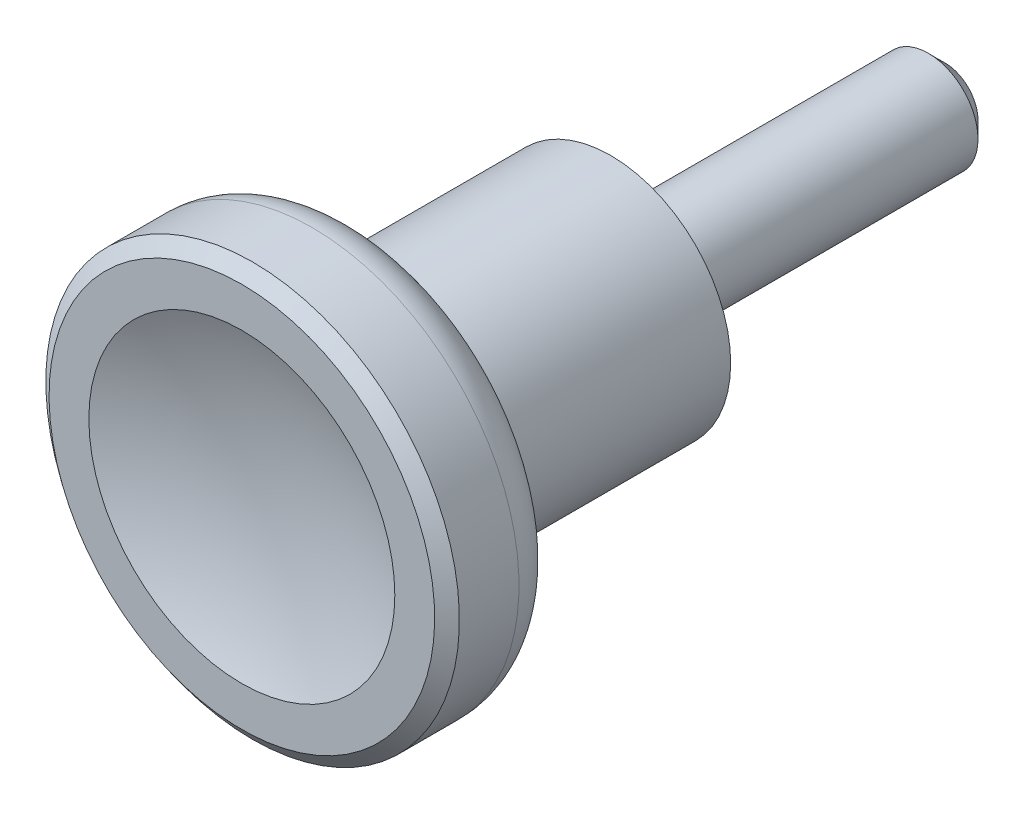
ISO-10303-21;
HEADER;
FILE_DESCRIPTION(('STEP AP214'),'2;1');
FILE_NAME('part.step','',(''),(''),'','','');
FILE_SCHEMA(('AUTOMOTIVE_DESIGN { 1 0 10303 214 1 1 1 1 }'));
ENDSEC;
DATA;
#1=APPLICATION_CONTEXT('core data for automotive mechanical design processes');
#2=APPLICATION_PROTOCOL_DEFINITION('international standard','automotive_design',2000,#1);
#3=PRODUCT_CONTEXT('',#1,'mechanical');
#4=PRODUCT('Part','Part','',(#3));
#5=PRODUCT_RELATED_PRODUCT_CATEGORY('part','',(#4));
#6=PRODUCT_DEFINITION_FORMATION('','',#4);
#7=PRODUCT_DEFINITION_CONTEXT('part definition',#1,'design');
#8=PRODUCT_DEFINITION('design','',#6,#7);
#9=PRODUCT_DEFINITION_SHAPE('','',#8);
#10=(LENGTH_UNIT() NAMED_UNIT(*) SI_UNIT(.MILLI.,.METRE.));
#11=(NAMED_UNIT(*) PLANE_ANGLE_UNIT() SI_UNIT($,.RADIAN.));
#12=(NAMED_UNIT(*) SI_UNIT($,.STERADIAN.) SOLID_ANGLE_UNIT());
#13=UNCERTAINTY_MEASURE_WITH_UNIT(LENGTH_MEASURE(1.E-05),#10,'distance_accuracy_value','');
#14=(GEOMETRIC_REPRESENTATION_CONTEXT(3) GLOBAL_UNCERTAINTY_ASSIGNED_CONTEXT((#13)) GLOBAL_UNIT_ASSIGNED_CONTEXT((#10,
#11,#12)) REPRESENTATION_CONTEXT('',''));
#15=CARTESIAN_POINT('',(0.,0.,0.));
#16=DIRECTION('',(0.,0.,1.));
#17=DIRECTION('',(1.,0.,0.));
#18=AXIS2_PLACEMENT_3D('',#15,#16,#17);
#19=CARTESIAN_POINT('',(0.,0.,43.6847281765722));
#20=DIRECTION('',(0.,-1.,0.));
#21=DIRECTION('',(1.,0.,0.));
#22=AXIS2_PLACEMENT_3D('',#19,#20,#21);
#23=SPHERICAL_SURFACE('',#22,23.1163945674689);
#24=CARTESIAN_POINT('',(0.,0.,43.6847281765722));
#25=DIRECTION('',(0.,0.,-1.));
#26=DIRECTION('',(0.,1.,0.));
#27=AXIS2_PLACEMENT_3D('',#24,#25,#26);
#28=SPHERICAL_SURFACE('',#27,23.1163945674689);
#29=CARTESIAN_POINT('',(0.,0.,22.4988392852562));
#30=DIRECTION('',(0.,0.,-1.));
#31=DIRECTION('',(0.,1.,0.));
#32=AXIS2_PLACEMENT_3D('',#29,#30,#31);
#33=CIRCLE('',#32,9.24801652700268);
#34=CARTESIAN_POINT('',(0.,9.24801652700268,22.4988392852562));
#35=VERTEX_POINT('',#34);
#36=EDGE_CURVE('E56',#35,#35,#33,.T.);
#37=ORIENTED_EDGE('',*,*,#36,.F.);
#38=EDGE_LOOP('',(#37));
#39=FACE_BOUND('',#38,.T.);
#40=ADVANCED_FACE('F12',(#39),#28,.F.);
#41=CARTESIAN_POINT('',(3.,0.,-20.));
#42=DIRECTION('',(0.,0.,1.));
#43=DIRECTION('',(0.,-1.,0.));
#44=AXIS2_PLACEMENT_3D('',#41,#42,#43);
#45=PLANE('',#44);
#46=CARTESIAN_POINT('',(0.,0.,-20.));
#47=DIRECTION('',(0.,0.,1.));
#48=DIRECTION('',(1.,0.,0.));
#49=AXIS2_PLACEMENT_3D('',#46,#47,#48);
#50=CIRCLE('',#49,2.);
#51=CARTESIAN_POINT('',(2.,0.,-20.));
#52=VERTEX_POINT('',#51);
#53=EDGE_CURVE('E19',#52,#52,#50,.F.);
#54=ORIENTED_EDGE('',*,*,#53,.T.);
#55=EDGE_LOOP('',(#54));
#56=FACE_BOUND('',#55,.T.);
#57=ADVANCED_FACE('F63',(#56),#45,.F.);
#58=CARTESIAN_POINT('',(0.,0.,-2.38339822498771));
#59=DIRECTION('',(0.,0.,-1.));
#60=DIRECTION('',(0.,1.,0.));
#61=AXIS2_PLACEMENT_3D('',#58,#59,#60);
#62=CYLINDRICAL_SURFACE('',#61,3.);
#63=CARTESIAN_POINT('',(0.,0.,-19.));
#64=DIRECTION('',(0.,0.,1.));
#65=DIRECTION('',(1.,0.,0.));
#66=AXIS2_PLACEMENT_3D('',#63,#64,#65);
#67=CIRCLE('',#66,3.);
#68=CARTESIAN_POINT('',(3.,0.,-19.));
#69=VERTEX_POINT('',#68);
#70=EDGE_CURVE('E8',#69,#69,#67,.T.);
#71=ORIENTED_EDGE('',*,*,#70,.T.);
#72=EDGE_LOOP('',(#71));
#73=FACE_BOUND('',#72,.T.);
#74=CARTESIAN_POINT('',(0.,0.,0.));
#75=DIRECTION('',(0.,0.,-1.));
#76=DIRECTION('',(0.,1.,0.));
#77=AXIS2_PLACEMENT_3D('',#74,#75,#76);
#78=CIRCLE('',#77,3.);
#79=CARTESIAN_POINT('',(0.,3.,0.));
#80=VERTEX_POINT('',#79);
#81=EDGE_CURVE('E23',#80,#80,#78,.T.);
#82=ORIENTED_EDGE('',*,*,#81,.T.);
#83=EDGE_LOOP('',(#82));
#84=FACE_BOUND('',#83,.T.);
#85=ADVANCED_FACE('F69',(#73,#84),#62,.T.);
#86=CARTESIAN_POINT('',(3.,0.,0.));
#87=DIRECTION('',(0.,0.,-1.));
#88=DIRECTION('',(0.,1.,0.));
#89=AXIS2_PLACEMENT_3D('',#86,#87,#88);
#90=PLANE('',#89);
#91=CARTESIAN_POINT('',(0.,0.,0.));
#92=DIRECTION('',(0.,0.,-1.));
#93=DIRECTION('',(0.,1.,0.));
#94=AXIS2_PLACEMENT_3D('',#91,#92,#93);
#95=CIRCLE('',#94,4.5);
#96=CARTESIAN_POINT('',(0.,4.5,0.));
#97=VERTEX_POINT('',#96);
#98=EDGE_CURVE('E27',#97,#97,#95,.T.);
#99=ORIENTED_EDGE('',*,*,#98,.T.);
#100=EDGE_LOOP('',(#99));
#101=FACE_BOUND('',#100,.T.);
#102=ORIENTED_EDGE('',*,*,#81,.F.);
#103=EDGE_LOOP('',(#102));
#104=FACE_BOUND('',#103,.T.);
#105=ADVANCED_FACE('F74',(#101,#104),#90,.T.);
#106=CARTESIAN_POINT('',(0.,0.,-2.38339822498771));
#107=DIRECTION('',(0.,0.,-1.));
#108=DIRECTION('',(0.,1.,0.));
#109=AXIS2_PLACEMENT_3D('',#106,#107,#108);
#110=CYLINDRICAL_SURFACE('',#109,4.5);
#111=ORIENTED_EDGE('',*,*,#98,.F.);
#112=EDGE_LOOP('',(#111));
#113=FACE_BOUND('',#112,.T.);
#114=CARTESIAN_POINT('',(0.,0.,0.200000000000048));
#115=DIRECTION('',(0.,0.,-1.));
#116=DIRECTION('',(0.,1.,0.));
#117=AXIS2_PLACEMENT_3D('',#114,#115,#116);
#118=CIRCLE('',#117,4.5);
#119=CARTESIAN_POINT('',(0.,4.5,0.200000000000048));
#120=VERTEX_POINT('',#119);
#121=EDGE_CURVE('E32',#120,#120,#118,.T.);
#122=ORIENTED_EDGE('',*,*,#121,.T.);
#123=EDGE_LOOP('',(#122));
#124=FACE_BOUND('',#123,.T.);
#125=ADVANCED_FACE('F77',(#113,#124),#110,.T.);
#126=CARTESIAN_POINT('',(4.5000000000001,0.,0.200000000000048));
#127=DIRECTION('',(0.,0.,-1.));
#128=DIRECTION('',(0.,1.,0.));
#129=AXIS2_PLACEMENT_3D('',#126,#127,#128);
#130=PLANE('',#129);
#131=CARTESIAN_POINT('',(0.,0.,0.200000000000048));
#132=DIRECTION('',(0.,0.,-1.));
#133=DIRECTION('',(0.,1.,0.));
#134=AXIS2_PLACEMENT_3D('',#131,#132,#133);
#135=CIRCLE('',#134,7.25);
#136=CARTESIAN_POINT('',(0.,7.25,0.200000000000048));
#137=VERTEX_POINT('',#136);
#138=EDGE_CURVE('E35',#137,#137,#135,.T.);
#139=ORIENTED_EDGE('',*,*,#138,.T.);
#140=EDGE_LOOP('',(#139));
#141=FACE_BOUND('',#140,.T.);
#142=ORIENTED_EDGE('',*,*,#121,.F.);
#143=EDGE_LOOP('',(#142));
#144=FACE_BOUND('',#143,.T.);
#145=ADVANCED_FACE('F81',(#141,#144),#130,.T.);
#146=CARTESIAN_POINT('',(0.,0.,-2.38339822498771));
#147=DIRECTION('',(0.,0.,-1.));
#148=DIRECTION('',(0.,1.,0.));
#149=AXIS2_PLACEMENT_3D('',#146,#147,#148);
#150=CYLINDRICAL_SURFACE('',#149,7.25);
#151=CARTESIAN_POINT('',(0.,0.,14.));
#152=DIRECTION('',(0.,0.,-1.));
#153=DIRECTION('',(0.,1.,0.));
#154=AXIS2_PLACEMENT_3D('',#151,#152,#153);
#155=CIRCLE('',#154,7.25);
#156=CARTESIAN_POINT('',(0.,7.25,14.));
#157=VERTEX_POINT('',#156);
#158=EDGE_CURVE('E38',#157,#157,#155,.T.);
#159=ORIENTED_EDGE('',*,*,#158,.T.);
#160=EDGE_LOOP('',(#159));
#161=FACE_BOUND('',#160,.T.);
#162=ORIENTED_EDGE('',*,*,#138,.F.);
#163=EDGE_LOOP('',(#162));
#164=FACE_BOUND('',#163,.T.);
#165=ADVANCED_FACE('F85',(#161,#164),#150,.T.);
#166=CARTESIAN_POINT('',(0.,0.,14.));
#167=DIRECTION('',(0.,0.,-1.));
#168=DIRECTION('',(0.,1.,0.));
#169=AXIS2_PLACEMENT_3D('',#166,#167,#168);
#170=TOROIDAL_SURFACE('',#169,7.75,0.5);
#171=ORIENTED_EDGE('',*,*,#158,.F.);
#172=EDGE_LOOP('',(#171));
#173=FACE_BOUND('',#172,.T.);
#174=CARTESIAN_POINT('',(0.,0.,14.4670163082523));
#175=DIRECTION('',(0.,0.,-1.));
#176=DIRECTION('',(0.,1.,0.));
#177=AXIS2_PLACEMENT_3D('',#174,#175,#176);
#178=CIRCLE('',#177,7.57140613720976);
#179=CARTESIAN_POINT('',(0.,7.57140613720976,14.4670163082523));
#180=VERTEX_POINT('',#179);
#181=EDGE_CURVE('E41',#180,#180,#178,.T.);
#182=ORIENTED_EDGE('',*,*,#181,.T.);
#183=EDGE_LOOP('',(#182));
#184=FACE_BOUND('',#183,.T.);
#185=ADVANCED_FACE('F89',(#173,#184),#170,.F.);
#186=CARTESIAN_POINT('',(0.,0.,14.4670163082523));
#187=DIRECTION('',(0.,0.,1.));
#188=DIRECTION('',(0.,-1.,0.));
#189=AXIS2_PLACEMENT_3D('',#186,#187,#188);
#190=CONICAL_SURFACE('',#189,7.57140613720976,1.20554106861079);
#191=CARTESIAN_POINT('',(0.,0.,15.675774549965));
#192=DIRECTION('',(0.,0.,-1.));
#193=DIRECTION('',(0.,1.,0.));
#194=AXIS2_PLACEMENT_3D('',#191,#192,#193);
#195=CIRCLE('',#194,10.7322639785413);
#196=CARTESIAN_POINT('',(0.,10.7322639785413,15.675774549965));
#197=VERTEX_POINT('',#196);
#198=EDGE_CURVE('E44',#197,#197,#195,.T.);
#199=ORIENTED_EDGE('',*,*,#198,.T.);
#200=EDGE_LOOP('',(#199));
#201=FACE_BOUND('',#200,.T.);
#202=ORIENTED_EDGE('',*,*,#181,.F.);
#203=EDGE_LOOP('',(#202));
#204=FACE_BOUND('',#203,.T.);
#205=ADVANCED_FACE('F93',(#201,#204),#190,.T.);
#206=CARTESIAN_POINT('',(0.,0.,18.2443675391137));
#207=DIRECTION('',(0.,0.,-1.));
#208=DIRECTION('',(0.,1.,0.));
#209=AXIS2_PLACEMENT_3D('',#206,#207,#208);
#210=TOROIDAL_SURFACE('',#209,9.74999647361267,2.75000352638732);
#211=CARTESIAN_POINT('',(0.,0.,18.2443675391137));
#212=DIRECTION('',(0.,0.,-1.));
#213=DIRECTION('',(0.,1.,0.));
#214=AXIS2_PLACEMENT_3D('',#211,#212,#213);
#215=CIRCLE('',#214,12.5);
#216=CARTESIAN_POINT('',(0.,12.5,18.2443675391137));
#217=VERTEX_POINT('',#216);
#218=EDGE_CURVE('E47',#217,#217,#215,.T.);
#219=ORIENTED_EDGE('',*,*,#218,.T.);
#220=EDGE_LOOP('',(#219));
#221=FACE_BOUND('',#220,.T.);
#222=ORIENTED_EDGE('',*,*,#198,.F.);
#223=EDGE_LOOP('',(#222));
#224=FACE_BOUND('',#223,.T.);
#225=ADVANCED_FACE('F97',(#221,#224),#210,.T.);
#226=CARTESIAN_POINT('',(0.,0.,-2.38339822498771));
#227=DIRECTION('',(0.,0.,-1.));
#228=DIRECTION('',(0.,1.,0.));
#229=AXIS2_PLACEMENT_3D('',#226,#227,#228);
#230=CYLINDRICAL_SURFACE('',#229,12.5);
#231=ORIENTED_EDGE('',*,*,#218,.F.);
#232=EDGE_LOOP('',(#231));
#233=FACE_BOUND('',#232,.T.);
#234=CARTESIAN_POINT('',(0.,0.,21.8478667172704));
#235=DIRECTION('',(0.,0.,-1.));
#236=DIRECTION('',(0.,1.,0.));
#237=AXIS2_PLACEMENT_3D('',#234,#235,#236);
#238=CIRCLE('',#237,12.5);
#239=CARTESIAN_POINT('',(0.,12.5,21.8478667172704));
#240=VERTEX_POINT('',#239);
#241=EDGE_CURVE('E50',#240,#240,#238,.T.);
#242=ORIENTED_EDGE('',*,*,#241,.T.);
#243=EDGE_LOOP('',(#242));
#244=FACE_BOUND('',#243,.T.);
#245=ADVANCED_FACE('F101',(#233,#244),#230,.T.);
#246=CARTESIAN_POINT('',(0.,0.,22.4983919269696));
#247=DIRECTION('',(0.,0.,-1.));
#248=DIRECTION('',(0.,1.,0.));
#249=AXIS2_PLACEMENT_3D('',#246,#247,#248);
#250=CONICAL_SURFACE('',#249,11.6552976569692,0.914540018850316);
#251=ORIENTED_EDGE('',*,*,#241,.F.);
#252=EDGE_LOOP('',(#251));
#253=FACE_BOUND('',#252,.T.);
#254=CARTESIAN_POINT('',(0.,0.,22.4983919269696));
#255=DIRECTION('',(0.,0.,-1.));
#256=DIRECTION('',(0.,1.,0.));
#257=AXIS2_PLACEMENT_3D('',#254,#255,#256);
#258=CIRCLE('',#257,11.6552976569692);
#259=CARTESIAN_POINT('',(0.,11.6552976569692,22.4983919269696));
#260=VERTEX_POINT('',#259);
#261=EDGE_CURVE('E53',#260,#260,#258,.T.);
#262=ORIENTED_EDGE('',*,*,#261,.T.);
#263=EDGE_LOOP('',(#262));
#264=FACE_BOUND('',#263,.T.);
#265=ADVANCED_FACE('F105',(#253,#264),#250,.T.);
#266=CARTESIAN_POINT('',(0.,0.,22.4988392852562));
#267=DIRECTION('',(0.,0.,-1.));
#268=DIRECTION('',(0.,1.,0.));
#269=AXIS2_PLACEMENT_3D('',#266,#267,#268);
#270=CONICAL_SURFACE('',#269,9.24801652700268,1.57061049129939);
#271=ORIENTED_EDGE('',*,*,#261,.F.);
#272=EDGE_LOOP('',(#271));
#273=FACE_BOUND('',#272,.T.);
#274=ORIENTED_EDGE('',*,*,#36,.T.);
#275=EDGE_LOOP('',(#274));
#276=FACE_BOUND('',#275,.T.);
#277=ADVANCED_FACE('F60',(#273,#276),#270,.T.);
#278=CARTESIAN_POINT('',(0.,0.,-20.));
#279=DIRECTION('',(0.,0.,1.));
#280=DIRECTION('',(1.,0.,0.));
#281=AXIS2_PLACEMENT_3D('',#278,#279,#280);
#282=CONICAL_SURFACE('',#281,2.,0.785398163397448);
#283=ORIENTED_EDGE('',*,*,#70,.F.);
#284=EDGE_LOOP('',(#283));
#285=FACE_BOUND('',#284,.T.);
#286=ORIENTED_EDGE('',*,*,#53,.F.);
#287=EDGE_LOOP('',(#286));
#288=FACE_BOUND('',#287,.T.);
#289=ADVANCED_FACE('F14',(#285,#288),#282,.T.);
#290=CLOSED_SHELL('',(#40,#57,#85,#105,#125,#145,#165,#185,#205,#225,#245,#265,#277,#289));
#291=MANIFOLD_SOLID_BREP('B1',#290);
#292=ADVANCED_BREP_SHAPE_REPRESENTATION('',(#18,#291),#14);
#293=SHAPE_DEFINITION_REPRESENTATION(#9,#292);
ENDSEC;
END-ISO-10303-21;
